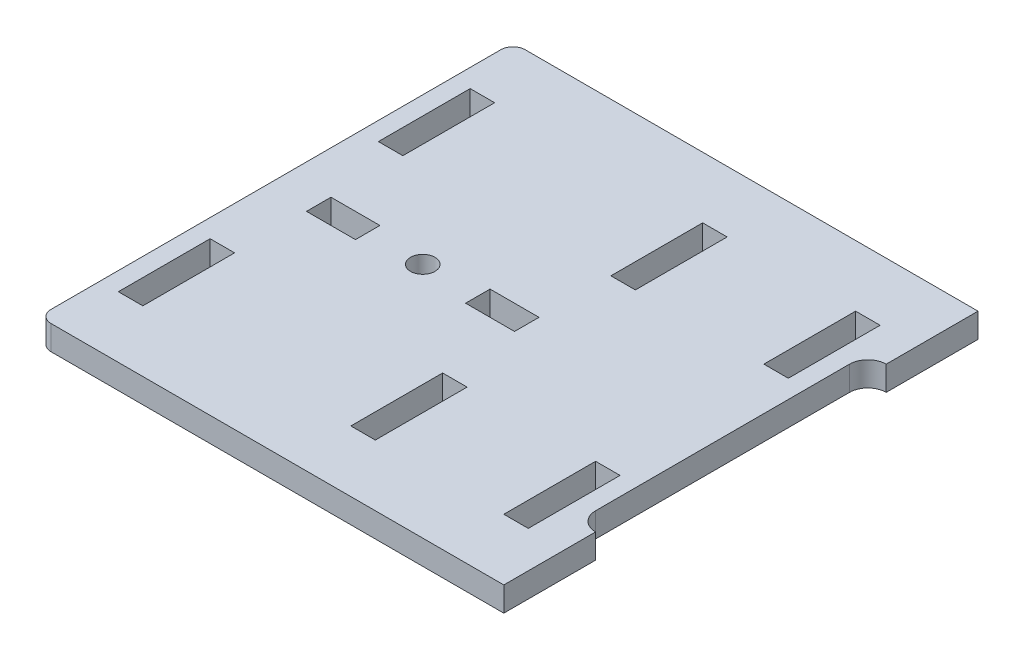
from build123d import *

# Parameters (mm, degrees)
SKIZZE2_R                       = 2
SKIZZE2_W                       = 4
SKIZZE2_H                       = 15
SKIZZE2_W_2                     = 8
SKIZZE2_H_2                     = 4
AUFSATZ_LINEAR_AUSTRAGEN1_DEPTH = 4


with BuildPart() as part:
    # Skizze2 → Aufsatz-Linear austragen1 (new body)
    with BuildSketch(Plane(origin=(0, 0, 0), x_dir=(1, 0, 0), z_dir=(0, 1, 0))):
        with BuildLine():
            Line((35, 20.75), (35, -20.75))
            ThreePointArc((35, -20.75), (35.878679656, -22.871320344), (38, -23.75))
            Line((38, -23.75), (38, -38.75))
            Line((38, -38.75), (-36, -38.75))
            ThreePointArc((-36, -38.75), (-37.414213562, -38.164213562), (-38, -36.75))
            Line((-38, -36.75), (-38, 36.75))
            ThreePointArc((-38, 36.75), (-37.414213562, 38.164213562), (-36, 38.75))
            Line((-36, 38.75), (38, 38.75))
            Line((38, 38.75), (38, 23.75))
            ThreePointArc((38, 23.75), (35.878679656, 22.871320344), (35, 20.75))
        make_face()
        with Locations(Location((-14, 0, 0), (0, 0, 270))):
            Circle(SKIZZE2_R, mode=Mode.SUBTRACT)
        with Locations((5, 21.25)):
            Rectangle(SKIZZE2_W, SKIZZE2_H, mode=Mode.SUBTRACT)
        with Locations((-33, 21.25)):
            Rectangle(SKIZZE2_W, SKIZZE2_H, mode=Mode.SUBTRACT)
        with Locations((30, 21.25)):
            Rectangle(SKIZZE2_W, SKIZZE2_H, mode=Mode.SUBTRACT)
        with Locations((30, -21.25)):
            Rectangle(SKIZZE2_W, SKIZZE2_H, mode=Mode.SUBTRACT)
        with Locations((5, -21.25)):
            Rectangle(SKIZZE2_W, SKIZZE2_H, mode=Mode.SUBTRACT)
        with Locations((-33, -21.25)):
            Rectangle(SKIZZE2_W, SKIZZE2_H, mode=Mode.SUBTRACT)
        with Locations((-27, 0)):
            Rectangle(SKIZZE2_W_2, SKIZZE2_H_2, mode=Mode.SUBTRACT)
        with Locations((-1, 0)):
            Rectangle(SKIZZE2_W_2, SKIZZE2_H_2, mode=Mode.SUBTRACT)
    extrude(amount=AUFSATZ_LINEAR_AUSTRAGEN1_DEPTH)


solid = part.part
